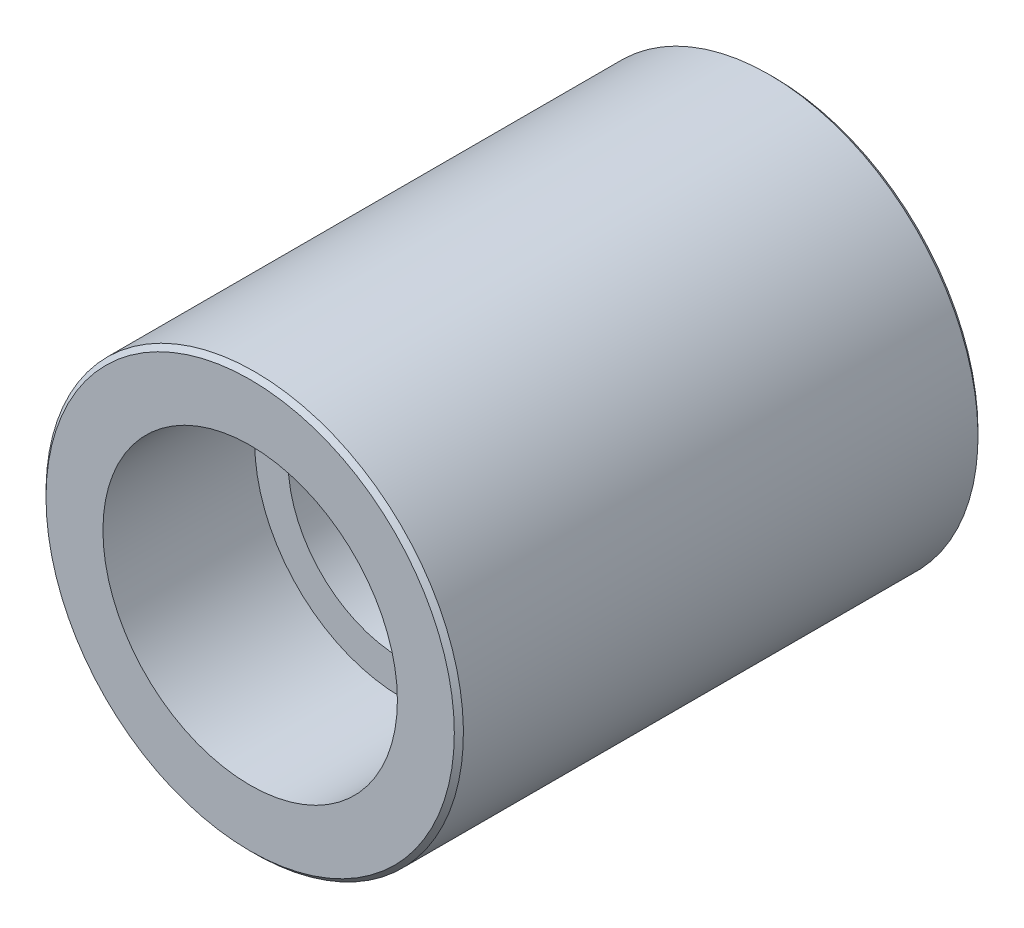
ISO-10303-21;
HEADER;
FILE_DESCRIPTION(('STEP AP214'),'2;1');
FILE_NAME('part.step','',(''),(''),'','','');
FILE_SCHEMA(('AUTOMOTIVE_DESIGN { 1 0 10303 214 1 1 1 1 }'));
ENDSEC;
DATA;
#1=APPLICATION_CONTEXT('core data for automotive mechanical design processes');
#2=APPLICATION_PROTOCOL_DEFINITION('international standard','automotive_design',2000,#1);
#3=PRODUCT_CONTEXT('',#1,'mechanical');
#4=PRODUCT('Part','Part','',(#3));
#5=PRODUCT_RELATED_PRODUCT_CATEGORY('part','',(#4));
#6=PRODUCT_DEFINITION_FORMATION('','',#4);
#7=PRODUCT_DEFINITION_CONTEXT('part definition',#1,'design');
#8=PRODUCT_DEFINITION('design','',#6,#7);
#9=PRODUCT_DEFINITION_SHAPE('','',#8);
#10=(LENGTH_UNIT() NAMED_UNIT(*) SI_UNIT(.MILLI.,.METRE.));
#11=(NAMED_UNIT(*) PLANE_ANGLE_UNIT() SI_UNIT($,.RADIAN.));
#12=(NAMED_UNIT(*) SI_UNIT($,.STERADIAN.) SOLID_ANGLE_UNIT());
#13=UNCERTAINTY_MEASURE_WITH_UNIT(LENGTH_MEASURE(1.E-05),#10,'distance_accuracy_value','');
#14=(GEOMETRIC_REPRESENTATION_CONTEXT(3) GLOBAL_UNCERTAINTY_ASSIGNED_CONTEXT((#13)) GLOBAL_UNIT_ASSIGNED_CONTEXT((#10,
#11,#12)) REPRESENTATION_CONTEXT('',''));
#15=CARTESIAN_POINT('',(0.,0.,0.));
#16=DIRECTION('',(0.,0.,1.));
#17=DIRECTION('',(1.,0.,0.));
#18=AXIS2_PLACEMENT_3D('',#15,#16,#17);
#19=CARTESIAN_POINT('',(0.,0.,0.));
#20=DIRECTION('',(0.,0.,1.));
#21=DIRECTION('',(0.,1.,0.));
#22=AXIS2_PLACEMENT_3D('',#19,#20,#21);
#23=PLANE('',#22);
#24=CARTESIAN_POINT('',(0.,0.,0.));
#25=DIRECTION('',(0.,0.,1.));
#26=DIRECTION('',(0.,1.,0.));
#27=AXIS2_PLACEMENT_3D('',#24,#25,#26);
#28=CIRCLE('',#27,17.0815);
#29=CARTESIAN_POINT('',(0.,17.0815,0.));
#30=VERTEX_POINT('',#29);
#31=EDGE_CURVE('E52',#30,#30,#28,.F.);
#32=ORIENTED_EDGE('',*,*,#31,.T.);
#33=EDGE_LOOP('',(#32));
#34=FACE_BOUND('',#33,.T.);
#35=CARTESIAN_POINT('',(0.,0.,0.));
#36=DIRECTION('',(0.,0.,1.));
#37=DIRECTION('',(0.,1.,0.));
#38=AXIS2_PLACEMENT_3D('',#35,#36,#37);
#39=CIRCLE('',#38,14.4526);
#40=CARTESIAN_POINT('',(0.,-14.4526,0.));
#41=VERTEX_POINT('',#40);
#42=EDGE_CURVE('E87',#41,#41,#39,.T.);
#43=ORIENTED_EDGE('',*,*,#42,.T.);
#44=EDGE_LOOP('',(#43));
#45=FACE_BOUND('',#44,.T.);
#46=ADVANCED_FACE('F44',(#34,#45),#23,.F.);
#47=CARTESIAN_POINT('',(0.,0.,43.815));
#48=DIRECTION('',(0.,0.,-1.));
#49=DIRECTION('',(0.,-1.,0.));
#50=AXIS2_PLACEMENT_3D('',#47,#48,#49);
#51=CYLINDRICAL_SURFACE('',#50,17.4625);
#52=CARTESIAN_POINT('',(0.,0.,0.380999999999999));
#53=DIRECTION('',(0.,0.,1.));
#54=DIRECTION('',(0.,1.,0.));
#55=AXIS2_PLACEMENT_3D('',#52,#53,#54);
#56=CIRCLE('',#55,17.4625);
#57=CARTESIAN_POINT('',(0.,17.4625,0.380999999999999));
#58=VERTEX_POINT('',#57);
#59=EDGE_CURVE('E59',#58,#58,#56,.T.);
#60=ORIENTED_EDGE('',*,*,#59,.T.);
#61=EDGE_LOOP('',(#60));
#62=FACE_BOUND('',#61,.T.);
#63=CARTESIAN_POINT('',(0.,0.,43.434));
#64=DIRECTION('',(0.,0.,1.));
#65=DIRECTION('',(0.,1.,0.));
#66=AXIS2_PLACEMENT_3D('',#63,#64,#65);
#67=CIRCLE('',#66,17.4625);
#68=CARTESIAN_POINT('',(0.,17.4625,43.434));
#69=VERTEX_POINT('',#68);
#70=EDGE_CURVE('E66',#69,#69,#67,.F.);
#71=ORIENTED_EDGE('',*,*,#70,.T.);
#72=EDGE_LOOP('',(#71));
#73=FACE_BOUND('',#72,.T.);
#74=ADVANCED_FACE('F134',(#62,#73),#51,.T.);
#75=CARTESIAN_POINT('',(0.,0.,43.815));
#76=DIRECTION('',(0.,0.,1.));
#77=DIRECTION('',(0.,1.,0.));
#78=AXIS2_PLACEMENT_3D('',#75,#76,#77);
#79=PLANE('',#78);
#80=CARTESIAN_POINT('',(0.,0.,43.815));
#81=DIRECTION('',(0.,0.,1.));
#82=DIRECTION('',(0.,1.,0.));
#83=AXIS2_PLACEMENT_3D('',#80,#81,#82);
#84=CIRCLE('',#83,12.319);
#85=CARTESIAN_POINT('',(0.,12.319,43.815));
#86=VERTEX_POINT('',#85);
#87=EDGE_CURVE('E95',#86,#86,#84,.T.);
#88=ORIENTED_EDGE('',*,*,#87,.F.);
#89=EDGE_LOOP('',(#88));
#90=FACE_BOUND('',#89,.T.);
#91=CARTESIAN_POINT('',(0.,0.,43.815));
#92=DIRECTION('',(0.,0.,1.));
#93=DIRECTION('',(0.,1.,0.));
#94=AXIS2_PLACEMENT_3D('',#91,#92,#93);
#95=CIRCLE('',#94,17.0815);
#96=CARTESIAN_POINT('',(0.,17.0815,43.815));
#97=VERTEX_POINT('',#96);
#98=EDGE_CURVE('E11',#97,#97,#95,.T.);
#99=ORIENTED_EDGE('',*,*,#98,.T.);
#100=EDGE_LOOP('',(#99));
#101=FACE_BOUND('',#100,.T.);
#102=ADVANCED_FACE('F139',(#90,#101),#79,.T.);
#103=CARTESIAN_POINT('',(0.,0.,0.380999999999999));
#104=DIRECTION('',(0.,0.,1.));
#105=DIRECTION('',(0.,1.,0.));
#106=AXIS2_PLACEMENT_3D('',#103,#104,#105);
#107=CONICAL_SURFACE('',#106,17.4625,0.785398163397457);
#108=ORIENTED_EDGE('',*,*,#31,.F.);
#109=EDGE_LOOP('',(#108));
#110=FACE_BOUND('',#109,.T.);
#111=ORIENTED_EDGE('',*,*,#59,.F.);
#112=EDGE_LOOP('',(#111));
#113=FACE_BOUND('',#112,.T.);
#114=ADVANCED_FACE('F130',(#110,#113),#107,.T.);
#115=CARTESIAN_POINT('',(0.,0.,43.815));
#116=DIRECTION('',(0.,0.,-1.));
#117=DIRECTION('',(0.,-1.,0.));
#118=AXIS2_PLACEMENT_3D('',#115,#116,#117);
#119=CONICAL_SURFACE('',#118,17.0815,0.785398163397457);
#120=ORIENTED_EDGE('',*,*,#70,.F.);
#121=EDGE_LOOP('',(#120));
#122=FACE_BOUND('',#121,.T.);
#123=ORIENTED_EDGE('',*,*,#98,.F.);
#124=EDGE_LOOP('',(#123));
#125=FACE_BOUND('',#124,.T.);
#126=ADVANCED_FACE('F46',(#122,#125),#119,.T.);
#127=CARTESIAN_POINT('',(0.,0.,0.787400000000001));
#128=DIRECTION('',(0.,0.,-1.));
#129=DIRECTION('',(0.168605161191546,-0.985683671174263,0.));
#130=AXIS2_PLACEMENT_3D('',#127,#128,#129);
#131=CYLINDRICAL_SURFACE('',#130,10.795);
#132=CARTESIAN_POINT('',(0.,0.,6.2738));
#133=DIRECTION('',(0.,0.,-1.));
#134=DIRECTION('',(0.168605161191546,-0.985683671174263,0.));
#135=AXIS2_PLACEMENT_3D('',#132,#133,#134);
#136=CIRCLE('',#135,10.795);
#137=CARTESIAN_POINT('',(1.82009271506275,-10.6404552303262,6.2738));
#138=VERTEX_POINT('',#137);
#139=EDGE_CURVE('E71',#138,#138,#136,.T.);
#140=ORIENTED_EDGE('',*,*,#139,.T.);
#141=EDGE_LOOP('',(#140));
#142=FACE_BOUND('',#141,.T.);
#143=CARTESIAN_POINT('',(0.,0.,27.94));
#144=DIRECTION('',(0.,0.,1.));
#145=DIRECTION('',(1.,0.,0.));
#146=AXIS2_PLACEMENT_3D('',#143,#144,#145);
#147=CIRCLE('',#146,10.795);
#148=CARTESIAN_POINT('',(10.795,0.,27.94));
#149=VERTEX_POINT('',#148);
#150=EDGE_CURVE('E111',#149,#149,#147,.F.);
#151=ORIENTED_EDGE('',*,*,#150,.F.);
#152=EDGE_LOOP('',(#151));
#153=FACE_BOUND('',#152,.T.);
#154=ADVANCED_FACE('F118',(#142,#153),#131,.F.);
#155=CARTESIAN_POINT('',(0.,0.,2.35303388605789));
#156=DIRECTION('',(0.,0.,-1.));
#157=DIRECTION('',(0.168605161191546,-0.985683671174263,0.));
#158=AXIS2_PLACEMENT_3D('',#155,#156,#157);
#159=CONICAL_SURFACE('',#158,11.8455661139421,0.26179938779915);
#160=ORIENTED_EDGE('',*,*,#139,.F.);
#161=EDGE_LOOP('',(#160));
#162=FACE_BOUND('',#161,.T.);
#163=CARTESIAN_POINT('',(0.,0.,2.35303388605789));
#164=DIRECTION('',(0.,0.,-1.));
#165=DIRECTION('',(0.168605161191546,-0.985683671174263,0.));
#166=AXIS2_PLACEMENT_3D('',#163,#164,#165);
#167=CIRCLE('',#166,11.8455661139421);
#168=CARTESIAN_POINT('',(1.99722358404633,-11.6759810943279,2.35303388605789));
#169=VERTEX_POINT('',#168);
#170=EDGE_CURVE('E75',#169,#169,#167,.T.);
#171=ORIENTED_EDGE('',*,*,#170,.T.);
#172=EDGE_LOOP('',(#171));
#173=FACE_BOUND('',#172,.T.);
#174=ADVANCED_FACE('F120',(#162,#173),#159,.F.);
#175=CARTESIAN_POINT('',(0.,0.,0.787400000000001));
#176=DIRECTION('',(0.,0.,-1.));
#177=DIRECTION('',(0.168605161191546,-0.985683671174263,0.));
#178=AXIS2_PLACEMENT_3D('',#175,#176,#177);
#179=CONICAL_SURFACE('',#178,13.4112,0.78539816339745);
#180=ORIENTED_EDGE('',*,*,#170,.F.);
#181=EDGE_LOOP('',(#180));
#182=FACE_BOUND('',#181,.T.);
#183=CARTESIAN_POINT('',(0.,0.,0.787400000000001));
#184=DIRECTION('',(0.,0.,-1.));
#185=DIRECTION('',(0.168605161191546,-0.985683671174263,0.));
#186=AXIS2_PLACEMENT_3D('',#183,#184,#185);
#187=CIRCLE('',#186,13.4112);
#188=CARTESIAN_POINT('',(2.26119753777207,-13.2192008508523,0.787399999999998));
#189=VERTEX_POINT('',#188);
#190=EDGE_CURVE('E79',#189,#189,#187,.T.);
#191=ORIENTED_EDGE('',*,*,#190,.T.);
#192=EDGE_LOOP('',(#191));
#193=FACE_BOUND('',#192,.T.);
#194=ADVANCED_FACE('F127',(#182,#193),#179,.F.);
#195=CARTESIAN_POINT('',(0.,0.,0.787400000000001));
#196=DIRECTION('',(0.,0.,-1.));
#197=DIRECTION('',(-1.,0.,0.));
#198=AXIS2_PLACEMENT_3D('',#195,#196,#197);
#199=PLANE('',#198);
#200=ORIENTED_EDGE('',*,*,#190,.F.);
#201=EDGE_LOOP('',(#200));
#202=FACE_BOUND('',#201,.T.);
#203=CARTESIAN_POINT('',(0.,0.,0.787400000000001));
#204=DIRECTION('',(0.,0.,-1.));
#205=DIRECTION('',(0.,-1.,0.));
#206=AXIS2_PLACEMENT_3D('',#203,#204,#205);
#207=CIRCLE('',#206,14.0716);
#208=CARTESIAN_POINT('',(0.,-14.0716,0.787400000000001));
#209=VERTEX_POINT('',#208);
#210=EDGE_CURVE('E91',#209,#209,#207,.F.);
#211=ORIENTED_EDGE('',*,*,#210,.F.);
#212=EDGE_LOOP('',(#211));
#213=FACE_BOUND('',#212,.T.);
#214=ADVANCED_FACE('F182',(#202,#213),#199,.T.);
#215=CARTESIAN_POINT('',(0.,0.,0.381000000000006));
#216=DIRECTION('',(0.,0.,-1.));
#217=DIRECTION('',(0.,-1.,0.));
#218=AXIS2_PLACEMENT_3D('',#215,#216,#217);
#219=CONICAL_SURFACE('',#218,14.0716,0.785398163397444);
#220=CARTESIAN_POINT('',(0.,0.,0.381000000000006));
#221=DIRECTION('',(0.,0.,1.));
#222=DIRECTION('',(0.,1.,0.));
#223=AXIS2_PLACEMENT_3D('',#220,#221,#222);
#224=CIRCLE('',#223,14.0716);
#225=CARTESIAN_POINT('',(0.,-14.0716,0.381000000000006));
#226=VERTEX_POINT('',#225);
#227=EDGE_CURVE('E83',#226,#226,#224,.F.);
#228=CARTESIAN_POINT('',(0.,-14.4526,0.));
#229=CARTESIAN_POINT('',(0.,-14.44863125,0.00396874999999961));
#230=CARTESIAN_POINT('',(0.,-14.4446625,0.0079374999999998));
#231=CARTESIAN_POINT('',(0.,-14.436725,0.0158750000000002));
#232=CARTESIAN_POINT('',(0.,-14.43275625,0.0198437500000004));
#233=CARTESIAN_POINT('',(0.,-14.42481875,0.0277812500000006));
#234=CARTESIAN_POINT('',(0.,-14.42085,0.0317500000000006));
#235=CARTESIAN_POINT('',(0.,-14.4129125,0.0396875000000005));
#236=CARTESIAN_POINT('',(0.,-14.40894375,0.0436562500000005));
#237=CARTESIAN_POINT('',(0.,-14.40100625,0.0515937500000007));
#238=CARTESIAN_POINT('',(0.,-14.3970375,0.055562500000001));
#239=CARTESIAN_POINT('',(0.,-14.3891,0.0635000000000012));
#240=CARTESIAN_POINT('',(0.,-14.38513125,0.0674687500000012));
#241=CARTESIAN_POINT('',(0.,-14.37719375,0.0754062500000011));
#242=CARTESIAN_POINT('',(0.,-14.373225,0.0793750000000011));
#243=CARTESIAN_POINT('',(0.,-14.3652875,0.0873125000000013));
#244=CARTESIAN_POINT('',(0.,-14.36131875,0.0912812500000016));
#245=CARTESIAN_POINT('',(0.,-14.35338125,0.0992187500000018));
#246=CARTESIAN_POINT('',(0.,-14.3494125,0.103187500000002));
#247=CARTESIAN_POINT('',(0.,-14.341475,0.111125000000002));
#248=CARTESIAN_POINT('',(0.,-14.33750625,0.115093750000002));
#249=CARTESIAN_POINT('',(0.,-14.32956875,0.123031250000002));
#250=CARTESIAN_POINT('',(0.,-14.3256,0.127000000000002));
#251=CARTESIAN_POINT('',(0.,-14.3176625,0.134937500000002));
#252=CARTESIAN_POINT('',(0.,-14.31369375,0.138906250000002));
#253=CARTESIAN_POINT('',(0.,-14.30575625,0.146843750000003));
#254=CARTESIAN_POINT('',(0.,-14.3017875,0.150812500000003));
#255=CARTESIAN_POINT('',(0.,-14.29385,0.158750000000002));
#256=CARTESIAN_POINT('',(0.,-14.28988125,0.162718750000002));
#257=CARTESIAN_POINT('',(0.,-14.28194375,0.170656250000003));
#258=CARTESIAN_POINT('',(0.,-14.277975,0.174625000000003));
#259=CARTESIAN_POINT('',(0.,-14.2700375,0.182562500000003));
#260=CARTESIAN_POINT('',(0.,-14.26606875,0.186531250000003));
#261=CARTESIAN_POINT('',(0.,-14.25813125,0.194468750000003));
#262=CARTESIAN_POINT('',(0.,-14.2541625,0.198437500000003));
#263=CARTESIAN_POINT('',(0.,-14.246225,0.206375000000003));
#264=CARTESIAN_POINT('',(0.,-14.24225625,0.210343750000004));
#265=CARTESIAN_POINT('',(0.,-14.23431875,0.218281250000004));
#266=CARTESIAN_POINT('',(0.,-14.23035,0.222250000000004));
#267=CARTESIAN_POINT('',(0.,-14.2224125,0.230187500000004));
#268=CARTESIAN_POINT('',(0.,-14.21844375,0.234156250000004));
#269=CARTESIAN_POINT('',(0.,-14.21050625,0.242093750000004));
#270=CARTESIAN_POINT('',(0.,-14.2065375,0.246062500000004));
#271=CARTESIAN_POINT('',(0.,-14.1986,0.254000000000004));
#272=CARTESIAN_POINT('',(0.,-14.19463125,0.257968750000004));
#273=CARTESIAN_POINT('',(0.,-14.18669375,0.265906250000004));
#274=CARTESIAN_POINT('',(0.,-14.182725,0.269875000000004));
#275=CARTESIAN_POINT('',(0.,-14.1747875,0.277812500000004));
#276=CARTESIAN_POINT('',(0.,-14.17081875,0.281781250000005));
#277=CARTESIAN_POINT('',(0.,-14.16288125,0.289718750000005));
#278=CARTESIAN_POINT('',(0.,-14.1589125,0.293687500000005));
#279=CARTESIAN_POINT('',(0.,-14.150975,0.301625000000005));
#280=CARTESIAN_POINT('',(0.,-14.14700625,0.305593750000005));
#281=CARTESIAN_POINT('',(0.,-14.13906875,0.313531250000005));
#282=CARTESIAN_POINT('',(0.,-14.1351,0.317500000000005));
#283=CARTESIAN_POINT('',(0.,-14.1271625,0.325437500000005));
#284=CARTESIAN_POINT('',(0.,-14.12319375,0.329406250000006));
#285=CARTESIAN_POINT('',(0.,-14.11525625,0.337343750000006));
#286=CARTESIAN_POINT('',(0.,-14.1112875,0.341312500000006));
#287=CARTESIAN_POINT('',(0.,-14.10335,0.349250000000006));
#288=CARTESIAN_POINT('',(0.,-14.09938125,0.353218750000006));
#289=CARTESIAN_POINT('',(0.,-14.09144375,0.361156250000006));
#290=CARTESIAN_POINT('',(0.,-14.087475,0.365125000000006));
#291=CARTESIAN_POINT('',(0.,-14.0795375,0.373062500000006));
#292=CARTESIAN_POINT('',(0.,-14.07556875,0.377031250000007));
#293=CARTESIAN_POINT('',(0.,-14.0716,0.381000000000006));
#294=B_SPLINE_CURVE_WITH_KNOTS('',3,(#228,#229,#230,#231,#232,#233,#234,#235,#236,#237,#238,
#239,#240,#241,#242,#243,#244,#245,#246,#247,#248,#249,#250,#251,#252,#253,#254,#255,#256,#257,
#258,#259,#260,#261,#262,#263,#264,#265,#266,#267,#268,#269,#270,#271,#272,#273,#274,#275,#276,
#277,#278,#279,#280,#281,#282,#283,#284,#285,#286,#287,#288,#289,#290,#291,#292,#293),
.UNSPECIFIED.,.F.,.F.,(4,2,2,2,2,2,2,2,2,2,2,2,2,2,2,2,2,2,2,2,2,2,2,2,2,2,2,2,2,2,2,2,4),(0.,
0.0168379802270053,0.0336759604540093,0.0505139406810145,0.0673519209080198,0.0841899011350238,
0.101027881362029,0.117865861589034,0.134703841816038,0.151541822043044,0.168379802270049,
0.185217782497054,0.202055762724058,0.218893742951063,0.235731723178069,0.252569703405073,
0.269407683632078,0.286245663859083,0.303083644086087,0.319921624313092,0.336759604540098,
0.353597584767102,0.370435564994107,0.387273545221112,0.404111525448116,0.420949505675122,
0.437787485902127,0.454625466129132,0.471463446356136,0.488301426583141,0.505139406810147,
0.521977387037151,0.538815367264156),.UNSPECIFIED.);
#295=EDGE_CURVE('BSEAM178',#41,#226,#294,.T.);
#296=ORIENTED_EDGE('',*,*,#42,.F.);
#297=ORIENTED_EDGE('',*,*,#227,.F.);
#298=ORIENTED_EDGE('',*,*,#295,.T.);
#299=ORIENTED_EDGE('',*,*,#295,.F.);
#300=EDGE_LOOP('',(#296,#298,#297,#299));
#301=FACE_BOUND('',#300,.T.);
#302=ADVANCED_FACE('F178',(#301),#219,.F.);
#303=CARTESIAN_POINT('',(0.,0.,27.94));
#304=DIRECTION('',(0.,0.,-1.));
#305=DIRECTION('',(0.,-1.,0.));
#306=AXIS2_PLACEMENT_3D('',#303,#304,#305);
#307=CYLINDRICAL_SURFACE('',#306,14.0716);
#308=ORIENTED_EDGE('',*,*,#227,.T.);
#309=EDGE_LOOP('',(#308));
#310=FACE_BOUND('',#309,.T.);
#311=ORIENTED_EDGE('',*,*,#210,.T.);
#312=EDGE_LOOP('',(#311));
#313=FACE_BOUND('',#312,.T.);
#314=ADVANCED_FACE('F170',(#310,#313),#307,.F.);
#315=CARTESIAN_POINT('',(0.,0.,31.115));
#316=DIRECTION('',(0.,0.,1.));
#317=DIRECTION('',(1.,0.,0.));
#318=AXIS2_PLACEMENT_3D('',#315,#316,#317);
#319=PLANE('',#318);
#320=CARTESIAN_POINT('',(0.,0.,31.115));
#321=DIRECTION('',(0.,0.,1.));
#322=DIRECTION('',(0.,1.,0.));
#323=AXIS2_PLACEMENT_3D('',#320,#321,#322);
#324=CIRCLE('',#323,9.525);
#325=CARTESIAN_POINT('',(0.,9.525,31.115));
#326=VERTEX_POINT('',#325);
#327=EDGE_CURVE('E103',#326,#326,#324,.T.);
#328=ORIENTED_EDGE('',*,*,#327,.F.);
#329=EDGE_LOOP('',(#328));
#330=FACE_BOUND('',#329,.T.);
#331=CARTESIAN_POINT('',(0.,0.,31.115));
#332=DIRECTION('',(0.,0.,1.));
#333=DIRECTION('',(0.,1.,0.));
#334=AXIS2_PLACEMENT_3D('',#331,#332,#333);
#335=CIRCLE('',#334,12.319);
#336=CARTESIAN_POINT('',(0.,12.319,31.115));
#337=VERTEX_POINT('',#336);
#338=EDGE_CURVE('E99',#337,#337,#335,.T.);
#339=ORIENTED_EDGE('',*,*,#338,.T.);
#340=EDGE_LOOP('',(#339));
#341=FACE_BOUND('',#340,.T.);
#342=ADVANCED_FACE('F161',(#330,#341),#319,.T.);
#343=CARTESIAN_POINT('',(0.,0.,31.115));
#344=DIRECTION('',(0.,0.,1.));
#345=DIRECTION('',(0.,1.,0.));
#346=AXIS2_PLACEMENT_3D('',#343,#344,#345);
#347=CYLINDRICAL_SURFACE('',#346,12.319);
#348=ORIENTED_EDGE('',*,*,#338,.F.);
#349=EDGE_LOOP('',(#348));
#350=FACE_BOUND('',#349,.T.);
#351=ORIENTED_EDGE('',*,*,#87,.T.);
#352=EDGE_LOOP('',(#351));
#353=FACE_BOUND('',#352,.T.);
#354=ADVANCED_FACE('F158',(#350,#353),#347,.F.);
#355=CARTESIAN_POINT('',(0.,0.,0.));
#356=DIRECTION('',(0.,0.,1.));
#357=DIRECTION('',(0.,1.,0.));
#358=AXIS2_PLACEMENT_3D('',#355,#356,#357);
#359=CYLINDRICAL_SURFACE('',#358,9.525);
#360=CARTESIAN_POINT('',(0.,0.,27.94));
#361=DIRECTION('',(0.,0.,1.));
#362=DIRECTION('',(1.,0.,0.));
#363=AXIS2_PLACEMENT_3D('',#360,#361,#362);
#364=CIRCLE('',#363,9.525);
#365=CARTESIAN_POINT('',(0.,9.525,27.94));
#366=VERTEX_POINT('',#365);
#367=EDGE_CURVE('E107',#366,#366,#364,.F.);
#368=CARTESIAN_POINT('',(0.,9.525,27.94));
#369=CARTESIAN_POINT('',(0.,9.525,27.9730729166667));
#370=CARTESIAN_POINT('',(0.,9.525,28.0061458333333));
#371=CARTESIAN_POINT('',(0.,9.525,28.0722916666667));
#372=CARTESIAN_POINT('',(0.,9.525,28.1053645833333));
#373=CARTESIAN_POINT('',(0.,9.525,28.1715104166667));
#374=CARTESIAN_POINT('',(0.,9.525,28.2045833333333));
#375=CARTESIAN_POINT('',(0.,9.525,28.2707291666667));
#376=CARTESIAN_POINT('',(0.,9.525,28.3038020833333));
#377=CARTESIAN_POINT('',(0.,9.525,28.3699479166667));
#378=CARTESIAN_POINT('',(0.,9.525,28.4030208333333));
#379=CARTESIAN_POINT('',(0.,9.525,28.4691666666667));
#380=CARTESIAN_POINT('',(0.,9.525,28.5022395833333));
#381=CARTESIAN_POINT('',(0.,9.525,28.5683854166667));
#382=CARTESIAN_POINT('',(0.,9.525,28.6014583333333));
#383=CARTESIAN_POINT('',(0.,9.525,28.6676041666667));
#384=CARTESIAN_POINT('',(0.,9.525,28.7006770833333));
#385=CARTESIAN_POINT('',(0.,9.525,28.7668229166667));
#386=CARTESIAN_POINT('',(0.,9.525,28.7998958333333));
#387=CARTESIAN_POINT('',(0.,9.525,28.8660416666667));
#388=CARTESIAN_POINT('',(0.,9.525,28.8991145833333));
#389=CARTESIAN_POINT('',(0.,9.525,28.9652604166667));
#390=CARTESIAN_POINT('',(0.,9.525,28.9983333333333));
#391=CARTESIAN_POINT('',(0.,9.525,29.0644791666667));
#392=CARTESIAN_POINT('',(0.,9.525,29.0975520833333));
#393=CARTESIAN_POINT('',(0.,9.525,29.1636979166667));
#394=CARTESIAN_POINT('',(0.,9.525,29.1967708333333));
#395=CARTESIAN_POINT('',(0.,9.525,29.2629166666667));
#396=CARTESIAN_POINT('',(0.,9.525,29.2959895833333));
#397=CARTESIAN_POINT('',(0.,9.525,29.3621354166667));
#398=CARTESIAN_POINT('',(0.,9.525,29.3952083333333));
#399=CARTESIAN_POINT('',(0.,9.525,29.4613541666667));
#400=CARTESIAN_POINT('',(0.,9.525,29.4944270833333));
#401=CARTESIAN_POINT('',(0.,9.525,29.5605729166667));
#402=CARTESIAN_POINT('',(0.,9.525,29.5936458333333));
#403=CARTESIAN_POINT('',(0.,9.525,29.6597916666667));
#404=CARTESIAN_POINT('',(0.,9.525,29.6928645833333));
#405=CARTESIAN_POINT('',(0.,9.525,29.7590104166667));
#406=CARTESIAN_POINT('',(0.,9.525,29.7920833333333));
#407=CARTESIAN_POINT('',(0.,9.525,29.8582291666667));
#408=CARTESIAN_POINT('',(0.,9.525,29.8913020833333));
#409=CARTESIAN_POINT('',(0.,9.525,29.9574479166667));
#410=CARTESIAN_POINT('',(0.,9.525,29.9905208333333));
#411=CARTESIAN_POINT('',(0.,9.525,30.0566666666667));
#412=CARTESIAN_POINT('',(0.,9.525,30.0897395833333));
#413=CARTESIAN_POINT('',(0.,9.525,30.1558854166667));
#414=CARTESIAN_POINT('',(0.,9.525,30.1889583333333));
#415=CARTESIAN_POINT('',(0.,9.525,30.2551041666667));
#416=CARTESIAN_POINT('',(0.,9.525,30.2881770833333));
#417=CARTESIAN_POINT('',(0.,9.525,30.3543229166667));
#418=CARTESIAN_POINT('',(0.,9.525,30.3873958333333));
#419=CARTESIAN_POINT('',(0.,9.525,30.4535416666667));
#420=CARTESIAN_POINT('',(0.,9.525,30.4866145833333));
#421=CARTESIAN_POINT('',(0.,9.525,30.5527604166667));
#422=CARTESIAN_POINT('',(0.,9.525,30.5858333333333));
#423=CARTESIAN_POINT('',(0.,9.525,30.6519791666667));
#424=CARTESIAN_POINT('',(0.,9.525,30.6850520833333));
#425=CARTESIAN_POINT('',(0.,9.525,30.7511979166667));
#426=CARTESIAN_POINT('',(0.,9.525,30.7842708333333));
#427=CARTESIAN_POINT('',(0.,9.525,30.8504166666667));
#428=CARTESIAN_POINT('',(0.,9.525,30.8834895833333));
#429=CARTESIAN_POINT('',(0.,9.525,30.9496354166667));
#430=CARTESIAN_POINT('',(0.,9.525,30.9827083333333));
#431=CARTESIAN_POINT('',(0.,9.525,31.0488541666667));
#432=CARTESIAN_POINT('',(0.,9.525,31.0819270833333));
#433=CARTESIAN_POINT('',(0.,9.525,31.115));
#434=B_SPLINE_CURVE_WITH_KNOTS('',3,(#368,#369,#370,#371,#372,#373,#374,#375,#376,#377,#378,
#379,#380,#381,#382,#383,#384,#385,#386,#387,#388,#389,#390,#391,#392,#393,#394,#395,#396,#397,
#398,#399,#400,#401,#402,#403,#404,#405,#406,#407,#408,#409,#410,#411,#412,#413,#414,#415,#416,
#417,#418,#419,#420,#421,#422,#423,#424,#425,#426,#427,#428,#429,#430,#431,#432,#433),
.UNSPECIFIED.,.F.,.F.,(4,2,2,2,2,2,2,2,2,2,2,2,2,2,2,2,2,2,2,2,2,2,2,2,2,2,2,2,2,2,2,2,4),(0.,
0.0992187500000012,0.198437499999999,0.29765625,0.396874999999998,0.496093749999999,0.5953125,
0.694531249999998,0.793749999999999,0.892968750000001,0.992187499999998,1.09140625,1.190625,
1.28984375,1.3890625,1.48828125,1.5875,1.68671875,1.7859375,1.88515625,1.984375,2.08359375,
2.1828125,2.28203125,2.38125,2.48046875,2.5796875,2.67890625,2.778125,2.87734375,2.9765625,
3.07578125,3.175),.UNSPECIFIED.);
#435=EDGE_CURVE('BSEAM160',#366,#326,#434,.T.);
#436=ORIENTED_EDGE('',*,*,#367,.T.);
#437=ORIENTED_EDGE('',*,*,#327,.T.);
#438=ORIENTED_EDGE('',*,*,#435,.T.);
#439=ORIENTED_EDGE('',*,*,#435,.F.);
#440=EDGE_LOOP('',(#436,#438,#437,#439));
#441=FACE_BOUND('',#440,.T.);
#442=ADVANCED_FACE('F160',(#441),#359,.F.);
#443=CARTESIAN_POINT('',(0.,0.,27.94));
#444=DIRECTION('',(0.,0.,1.));
#445=DIRECTION('',(1.,0.,0.));
#446=AXIS2_PLACEMENT_3D('',#443,#444,#445);
#447=PLANE('',#446);
#448=ORIENTED_EDGE('',*,*,#150,.T.);
#449=EDGE_LOOP('',(#448));
#450=FACE_BOUND('',#449,.T.);
#451=ORIENTED_EDGE('',*,*,#367,.F.);
#452=EDGE_LOOP('',(#451));
#453=FACE_BOUND('',#452,.T.);
#454=ADVANCED_FACE('F115',(#450,#453),#447,.F.);
#455=CLOSED_SHELL('',(#46,#74,#102,#114,#126,#154,#174,#194,#214,#302,#314,#342,#354,#442,#454));
#456=MANIFOLD_SOLID_BREP('B2',#455);
#457=ADVANCED_BREP_SHAPE_REPRESENTATION('',(#18,#456),#14);
#458=SHAPE_DEFINITION_REPRESENTATION(#9,#457);
ENDSEC;
END-ISO-10303-21;
